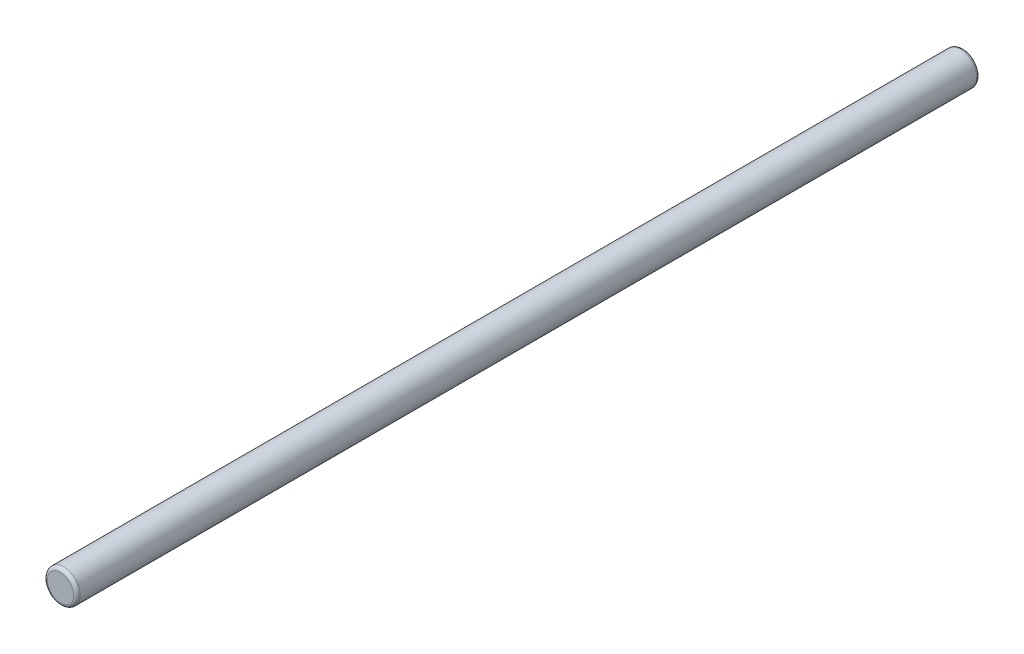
ISO-10303-21;
HEADER;
FILE_DESCRIPTION(('STEP AP214'),'2;1');
FILE_NAME('part.step','',(''),(''),'','','');
FILE_SCHEMA(('AUTOMOTIVE_DESIGN { 1 0 10303 214 1 1 1 1 }'));
ENDSEC;
DATA;
#1=APPLICATION_CONTEXT('core data for automotive mechanical design processes');
#2=APPLICATION_PROTOCOL_DEFINITION('international standard','automotive_design',2000,#1);
#3=PRODUCT_CONTEXT('',#1,'mechanical');
#4=PRODUCT('Part','Part','',(#3));
#5=PRODUCT_RELATED_PRODUCT_CATEGORY('part','',(#4));
#6=PRODUCT_DEFINITION_FORMATION('','',#4);
#7=PRODUCT_DEFINITION_CONTEXT('part definition',#1,'design');
#8=PRODUCT_DEFINITION('design','',#6,#7);
#9=PRODUCT_DEFINITION_SHAPE('','',#8);
#10=(LENGTH_UNIT() NAMED_UNIT(*) SI_UNIT(.MILLI.,.METRE.));
#11=(NAMED_UNIT(*) PLANE_ANGLE_UNIT() SI_UNIT($,.RADIAN.));
#12=(NAMED_UNIT(*) SI_UNIT($,.STERADIAN.) SOLID_ANGLE_UNIT());
#13=UNCERTAINTY_MEASURE_WITH_UNIT(LENGTH_MEASURE(1.E-05),#10,'distance_accuracy_value','');
#14=(GEOMETRIC_REPRESENTATION_CONTEXT(3) GLOBAL_UNCERTAINTY_ASSIGNED_CONTEXT((#13)) GLOBAL_UNIT_ASSIGNED_CONTEXT((#10,
#11,#12)) REPRESENTATION_CONTEXT('',''));
#15=CARTESIAN_POINT('',(0.,0.,0.));
#16=DIRECTION('',(0.,0.,1.));
#17=DIRECTION('',(1.,0.,0.));
#18=AXIS2_PLACEMENT_3D('',#15,#16,#17);
#19=CARTESIAN_POINT('',(0.,0.,137.5));
#20=DIRECTION('',(0.,0.,-1.));
#21=DIRECTION('',(-1.,0.,0.));
#22=AXIS2_PLACEMENT_3D('',#19,#20,#21);
#23=CYLINDRICAL_SURFACE('',#22,5.);
#24=CARTESIAN_POINT('',(0.,0.,-136.5));
#25=DIRECTION('',(0.,0.,1.));
#26=DIRECTION('',(1.,0.,0.));
#27=AXIS2_PLACEMENT_3D('',#24,#25,#26);
#28=CIRCLE('',#27,5.);
#29=CARTESIAN_POINT('',(5.,0.,-136.5));
#30=VERTEX_POINT('',#29);
#31=EDGE_CURVE('E42',#30,#30,#28,.T.);
#32=ORIENTED_EDGE('',*,*,#31,.T.);
#33=EDGE_LOOP('',(#32));
#34=FACE_BOUND('',#33,.T.);
#35=CARTESIAN_POINT('',(0.,0.,136.5));
#36=DIRECTION('',(0.,0.,1.));
#37=DIRECTION('',(1.,0.,0.));
#38=AXIS2_PLACEMENT_3D('',#35,#36,#37);
#39=CIRCLE('',#38,5.);
#40=CARTESIAN_POINT('',(5.,0.,136.5));
#41=VERTEX_POINT('',#40);
#42=EDGE_CURVE('E46',#41,#41,#39,.F.);
#43=ORIENTED_EDGE('',*,*,#42,.T.);
#44=EDGE_LOOP('',(#43));
#45=FACE_BOUND('',#44,.T.);
#46=ADVANCED_FACE('F31',(#34,#45),#23,.T.);
#47=CARTESIAN_POINT('',(0.,0.,137.5));
#48=DIRECTION('',(0.,0.,1.));
#49=DIRECTION('',(1.,0.,0.));
#50=AXIS2_PLACEMENT_3D('',#47,#48,#49);
#51=PLANE('',#50);
#52=CARTESIAN_POINT('',(0.,0.,137.5));
#53=DIRECTION('',(0.,0.,1.));
#54=DIRECTION('',(1.,0.,0.));
#55=AXIS2_PLACEMENT_3D('',#52,#53,#54);
#56=CIRCLE('',#55,4.);
#57=CARTESIAN_POINT('',(4.,0.,137.5));
#58=VERTEX_POINT('',#57);
#59=EDGE_CURVE('E10',#58,#58,#56,.T.);
#60=ORIENTED_EDGE('',*,*,#59,.T.);
#61=EDGE_LOOP('',(#60));
#62=FACE_BOUND('',#61,.T.);
#63=ADVANCED_FACE('F62',(#62),#51,.T.);
#64=CARTESIAN_POINT('',(0.,0.,-137.5));
#65=DIRECTION('',(0.,0.,1.));
#66=DIRECTION('',(1.,0.,0.));
#67=AXIS2_PLACEMENT_3D('',#64,#65,#66);
#68=PLANE('',#67);
#69=CARTESIAN_POINT('',(0.,0.,-137.5));
#70=DIRECTION('',(0.,0.,1.));
#71=DIRECTION('',(1.,0.,0.));
#72=AXIS2_PLACEMENT_3D('',#69,#70,#71);
#73=CIRCLE('',#72,4.);
#74=CARTESIAN_POINT('',(4.,0.,-137.5));
#75=VERTEX_POINT('',#74);
#76=EDGE_CURVE('E38',#75,#75,#73,.F.);
#77=ORIENTED_EDGE('',*,*,#76,.T.);
#78=EDGE_LOOP('',(#77));
#79=FACE_BOUND('',#78,.T.);
#80=ADVANCED_FACE('F59',(#79),#68,.F.);
#81=CARTESIAN_POINT('',(0.,0.,-136.5));
#82=DIRECTION('',(0.,0.,1.));
#83=DIRECTION('',(1.,0.,0.));
#84=AXIS2_PLACEMENT_3D('',#81,#82,#83);
#85=TOROIDAL_SURFACE('',#84,4.,1.);
#86=ORIENTED_EDGE('',*,*,#76,.F.);
#87=EDGE_LOOP('',(#86));
#88=FACE_BOUND('',#87,.T.);
#89=ORIENTED_EDGE('',*,*,#31,.F.);
#90=EDGE_LOOP('',(#89));
#91=FACE_BOUND('',#90,.T.);
#92=ADVANCED_FACE('F55',(#88,#91),#85,.T.);
#93=CARTESIAN_POINT('',(0.,0.,136.5));
#94=DIRECTION('',(0.,0.,1.));
#95=DIRECTION('',(1.,0.,0.));
#96=AXIS2_PLACEMENT_3D('',#93,#94,#95);
#97=TOROIDAL_SURFACE('',#96,4.,1.);
#98=ORIENTED_EDGE('',*,*,#42,.F.);
#99=EDGE_LOOP('',(#98));
#100=FACE_BOUND('',#99,.T.);
#101=ORIENTED_EDGE('',*,*,#59,.F.);
#102=EDGE_LOOP('',(#101));
#103=FACE_BOUND('',#102,.T.);
#104=ADVANCED_FACE('F33',(#100,#103),#97,.T.);
#105=CLOSED_SHELL('',(#46,#63,#80,#92,#104));
#106=MANIFOLD_SOLID_BREP('B2',#105);
#107=ADVANCED_BREP_SHAPE_REPRESENTATION('',(#18,#106),#14);
#108=SHAPE_DEFINITION_REPRESENTATION(#9,#107);
ENDSEC;
END-ISO-10303-21;
